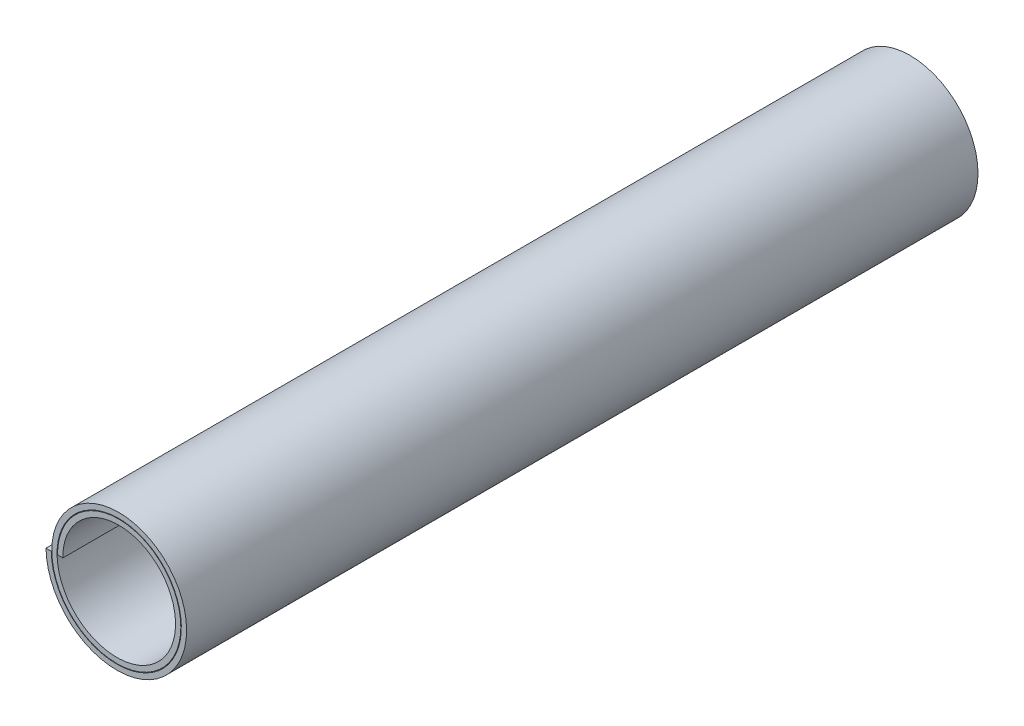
from build123d import *

# Parameters (mm, degrees)
SKETCH2_W = 0.127
SKETCH2_H = 19.05


with BuildPart() as part:
    # Sweep1: sweep along a curve in space
    with BuildLine() as sweep1_path:
        add(Edge.make_bspline(
            [(-1.6637, 0, 0), (-1.660789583, -0.217777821, 0), (-1.614583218, -0.434298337, 0), (-1.443400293, -0.832359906, 0), (-1.318499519, -1.013747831, 0), (-1.009631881, -1.314383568, 0), (-0.825792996, -1.433519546, 0), (-0.427500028, -1.592197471, 0), (-0.213206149, -1.631685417, 0), (0.213206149, -1.625864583, 0), (0.425156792, -1.580567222, 0), (0.814771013, -1.412883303, 0), (0.992284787, -1.290571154, 0), (1.286455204, -0.988168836, 0), (1.403002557, -0.808204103, 0), (1.558181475, -0.418358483, 0), (1.596760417, -0.208634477, 0), (1.590939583, 0.208634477, 0), (1.546551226, 0.416015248, 0), (1.382366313, 0.79718212, 0), (1.26264279, 0.970821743, 0), (0.966705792, 1.258526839, 0), (0.79061521, 1.372485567, 0), (0.409216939, 1.52416548, 0), (0.204062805, 1.561835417, 0), (-0.204062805, 1.556014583, 0), (-0.406873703, 1.51253523, 0), (-0.779593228, 1.351849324, 0), (-0.949358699, 1.234714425, 0), (-1.230598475, 0.945242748, 0), (-1.341968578, 0.773026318, 0), (-1.490149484, 0.400075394, 0), (-1.526910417, 0.199491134, 0), (-1.521089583, -0.199491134, 0), (-1.478519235, -0.397732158, 0), (-1.321332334, -0.762004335, 0), (-1.206786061, -0.927895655, 0), (-0.923779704, -1.20267011, 0), (-0.755437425, -1.311451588, 0), (-0.390933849, -1.456133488, 0), (-0.194919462, -1.491985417, 0), (0.194919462, -1.486164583, 0), (0.388590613, -1.444503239, 0), (0.744415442, -1.290815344, 0), (0.90643261, -1.178857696, 0), (1.174741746, -0.90231666, 0), (1.280934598, -0.737848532, 0), (1.422117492, -0.381792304, 0), (1.457060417, -0.19034779, 0), (1.451239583, 0.19034779, 0), (1.410487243, 0.379449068, 0), (1.260298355, 0.726826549, 0), (1.150929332, 0.884969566, 0), (0.880853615, 1.146813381, 0), (0.720259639, 1.250417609, 0), (0.372650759, 1.388101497, 0), (0.185776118, 1.422135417, 0), (-0.185776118, 1.416314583, 0), (-0.370307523, 1.376471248, 0), (-0.709237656, 1.229781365, 0), (-0.863506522, 1.123000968, 0), (-1.118885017, 0.859390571, 0), (-1.219900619, 0.702670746, 0), (-1.354085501, 0.363509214, 0), (-1.387210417, 0.181204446, 0), (-1.3843, 0, 0)],
            knots=[0, 0, 0, 0, 0.03125, 0.03125, 0.0625, 0.0625, 0.09375, 0.09375, 0.125, 0.125, 0.15625, 0.15625, 0.1875, 0.1875, 0.21875, 0.21875, 0.25, 0.25, 0.28125, 0.28125, 0.3125, 0.3125, 0.34375, 0.34375, 0.375, 0.375, 0.40625, 0.40625, 0.4375, 0.4375, 0.46875, 0.46875, 0.5, 0.5, 0.53125, 0.53125, 0.5625, 0.5625, 0.59375, 0.59375, 0.625, 0.625, 0.65625, 0.65625, 0.6875, 0.6875, 0.71875, 0.71875, 0.75, 0.75, 0.78125, 0.78125, 0.8125, 0.8125, 0.84375, 0.84375, 0.875, 0.875, 0.90625, 0.90625, 0.9375, 0.9375, 0.96875, 0.96875, 1, 1, 1, 1], degree=3))
    # Sketch2 → Sweep1 (sweep)
    with BuildSketch(Plane(origin=(0, 0, 0), x_dir=(1, 0, 0), z_dir=(0, 1, 0))):
        with Locations((-1.6637, 9.525)):
            Rectangle(SKETCH2_W, SKETCH2_H)
    sweep(path=sweep1_path.line, is_frenet=True)


solid = part.part
